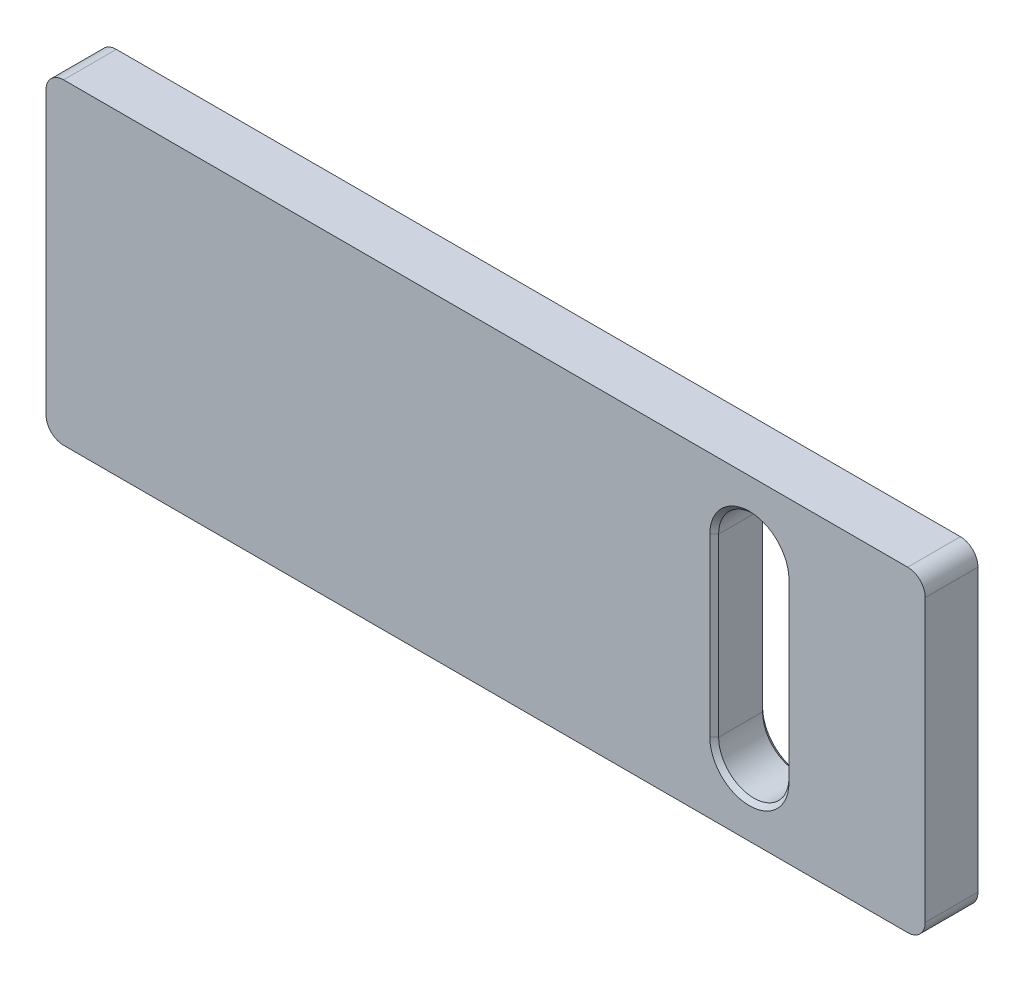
from build123d import *

# Parameters (mm, degrees)
ESQUISSE1_W             = 50
ESQUISSE1_H             = 18
BOSS_EXTRU_1_DEPTH      = 3
ENL_V_MAT_EXTRU_1_REACH = 28.739
CONG_1_R                = 1
CHANFREIN1_SIZE         = 0.25


with BuildPart() as part:
    # Esquisse1 → Boss.-Extru.1 (new body)
    with BuildSketch(Plane.XY):
        Rectangle(ESQUISSE1_W, ESQUISSE1_H)
    extrude(amount=BOSS_EXTRU_1_DEPTH)

    # Esquisse2 → Enl_v. mat.-Extru.1 (cut, up to next)
    with BuildSketch(Plane.XY.offset(3), mode=Mode.PRIVATE) as enl_v_mat_extru_1_sk1:
        with BuildLine():
            Line((17, 5), (17, -5))
            ThreePointArc((17, -5), (15, -7), (13, -5))
            Line((13, -5), (13, 5))
            ThreePointArc((13, 5), (15, 7), (17, 5))
        make_face()
    enl_v_mat_extru_1_tool1 = extrude(enl_v_mat_extru_1_sk1.sketch, amount=-ENL_V_MAT_EXTRU_1_REACH, mode=Mode.PRIVATE) & part.part
    add(enl_v_mat_extru_1_tool1.solids().sort_by_distance((15, 0, 3))[0], mode=Mode.SUBTRACT)

    # Cong_1
    cong_1_edges = [part.edges().sort_by_distance(p)[0] for p in [
        (25, -9, 1.5),
        (-25, -9, 1.5),
        (-25, 9, 1.5),
        (25, 9, 1.5),
    ]]
    fillet(cong_1_edges, radius=CONG_1_R)

    # Chanfrein1
    chanfrein1_edges = [part.edges().sort_by_distance(p)[0] for p in [
        (15, 7, 3),
        (13, 0, 3),
        (15, -7, 3),
        (17, 0, 3),
        (13, 0, 0),
        (15, 7, 0),
        (17, 0, 0),
        (15, -7, 0),
    ]]
    chamfer(chanfrein1_edges, length=CHANFREIN1_SIZE)


solid = part.part
